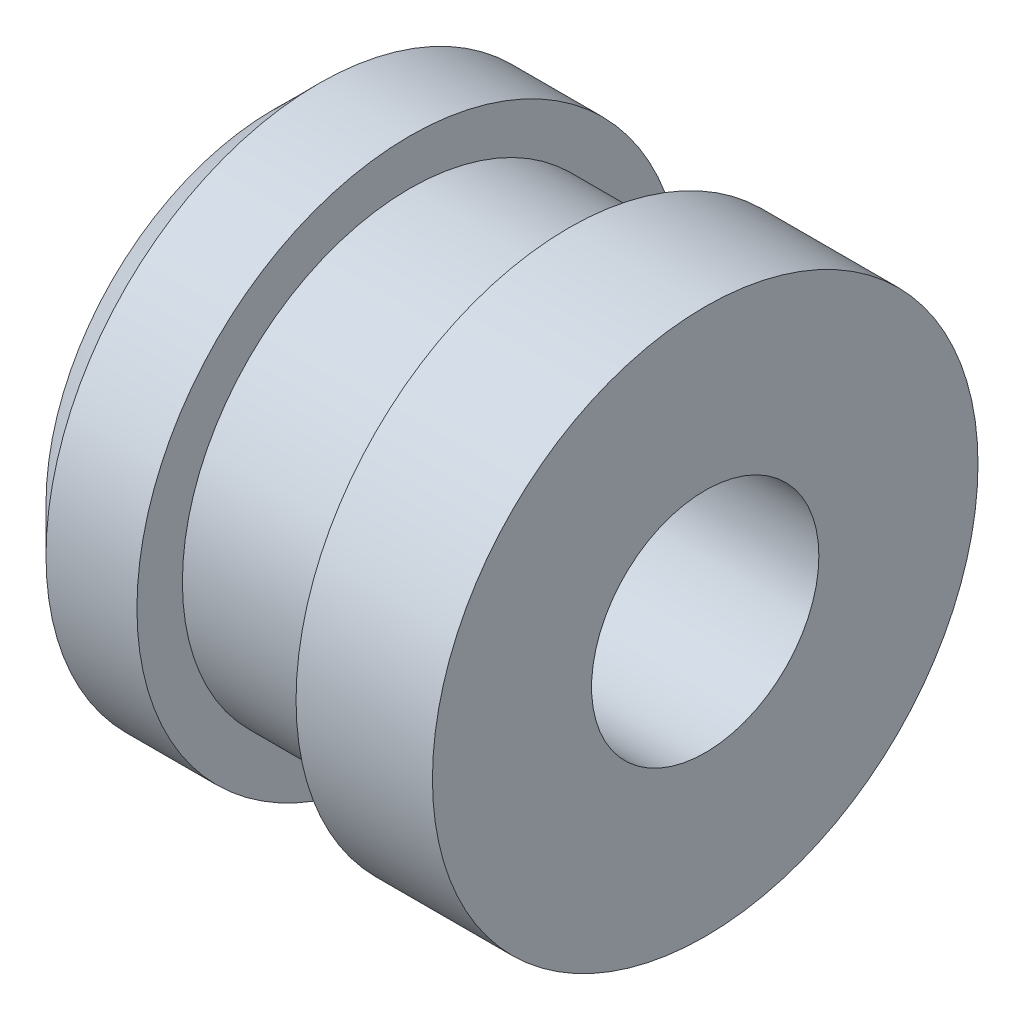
ISO-10303-21;
HEADER;
FILE_DESCRIPTION(('STEP AP214'),'2;1');
FILE_NAME('part.step','',(''),(''),'','','');
FILE_SCHEMA(('AUTOMOTIVE_DESIGN { 1 0 10303 214 1 1 1 1 }'));
ENDSEC;
DATA;
#1=APPLICATION_CONTEXT('core data for automotive mechanical design processes');
#2=APPLICATION_PROTOCOL_DEFINITION('international standard','automotive_design',2000,#1);
#3=PRODUCT_CONTEXT('',#1,'mechanical');
#4=PRODUCT('Part','Part','',(#3));
#5=PRODUCT_RELATED_PRODUCT_CATEGORY('part','',(#4));
#6=PRODUCT_DEFINITION_FORMATION('','',#4);
#7=PRODUCT_DEFINITION_CONTEXT('part definition',#1,'design');
#8=PRODUCT_DEFINITION('design','',#6,#7);
#9=PRODUCT_DEFINITION_SHAPE('','',#8);
#10=(LENGTH_UNIT() NAMED_UNIT(*) SI_UNIT(.MILLI.,.METRE.));
#11=(NAMED_UNIT(*) PLANE_ANGLE_UNIT() SI_UNIT($,.RADIAN.));
#12=(NAMED_UNIT(*) SI_UNIT($,.STERADIAN.) SOLID_ANGLE_UNIT());
#13=UNCERTAINTY_MEASURE_WITH_UNIT(LENGTH_MEASURE(1.E-05),#10,'distance_accuracy_value','');
#14=(GEOMETRIC_REPRESENTATION_CONTEXT(3) GLOBAL_UNCERTAINTY_ASSIGNED_CONTEXT((#13)) GLOBAL_UNIT_ASSIGNED_CONTEXT((#10,
#11,#12)) REPRESENTATION_CONTEXT('',''));
#15=CARTESIAN_POINT('',(0.,0.,0.));
#16=DIRECTION('',(0.,0.,1.));
#17=DIRECTION('',(1.,0.,0.));
#18=AXIS2_PLACEMENT_3D('',#15,#16,#17);
#19=CARTESIAN_POINT('',(0.,0.,-6.));
#20=DIRECTION('',(1.,0.,0.));
#21=DIRECTION('',(0.,0.,-1.));
#22=AXIS2_PLACEMENT_3D('',#19,#20,#21);
#23=PLANE('',#22);
#24=CARTESIAN_POINT('',(0.,0.,0.));
#25=DIRECTION('',(1.,0.,0.));
#26=DIRECTION('',(0.,0.,-1.));
#27=AXIS2_PLACEMENT_3D('',#24,#25,#26);
#28=CIRCLE('',#27,5.);
#29=CARTESIAN_POINT('',(0.,0.,-5.));
#30=VERTEX_POINT('',#29);
#31=EDGE_CURVE('E36',#30,#30,#28,.F.);
#32=ORIENTED_EDGE('',*,*,#31,.T.);
#33=EDGE_LOOP('',(#32));
#34=FACE_BOUND('',#33,.T.);
#35=ADVANCED_FACE('F30',(#34),#23,.F.);
#36=CARTESIAN_POINT('',(9.49999999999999,0.,0.));
#37=DIRECTION('',(-1.,0.,0.));
#38=DIRECTION('',(0.,0.,1.));
#39=AXIS2_PLACEMENT_3D('',#36,#37,#38);
#40=PLANE('',#39);
#41=CARTESIAN_POINT('',(9.49999999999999,0.,0.));
#42=DIRECTION('',(1.,0.,0.));
#43=DIRECTION('',(0.,0.,-1.));
#44=AXIS2_PLACEMENT_3D('',#41,#42,#43);
#45=CIRCLE('',#44,2.5);
#46=CARTESIAN_POINT('',(9.49999999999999,0.,-2.5));
#47=VERTEX_POINT('',#46);
#48=EDGE_CURVE('E61',#47,#47,#45,.T.);
#49=ORIENTED_EDGE('',*,*,#48,.F.);
#50=EDGE_LOOP('',(#49));
#51=FACE_BOUND('',#50,.T.);
#52=CARTESIAN_POINT('',(9.49999999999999,0.,0.));
#53=DIRECTION('',(-1.,0.,0.));
#54=DIRECTION('',(0.,0.,1.));
#55=AXIS2_PLACEMENT_3D('',#52,#53,#54);
#56=CIRCLE('',#55,6.);
#57=CARTESIAN_POINT('',(9.49999999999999,0.,6.));
#58=VERTEX_POINT('',#57);
#59=EDGE_CURVE('E40',#58,#58,#56,.T.);
#60=ORIENTED_EDGE('',*,*,#59,.F.);
#61=EDGE_LOOP('',(#60));
#62=FACE_BOUND('',#61,.T.);
#63=ADVANCED_FACE('F67',(#51,#62),#40,.F.);
#64=CARTESIAN_POINT('',(0.,0.,0.));
#65=DIRECTION('',(-1.,0.,0.));
#66=DIRECTION('',(0.,0.,1.));
#67=AXIS2_PLACEMENT_3D('',#64,#65,#66);
#68=CYLINDRICAL_SURFACE('',#67,6.);
#69=CARTESIAN_POINT('',(6.49999999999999,0.,0.));
#70=DIRECTION('',(-1.,0.,0.));
#71=DIRECTION('',(0.,0.,1.));
#72=AXIS2_PLACEMENT_3D('',#69,#70,#71);
#73=CIRCLE('',#72,6.);
#74=CARTESIAN_POINT('',(6.49999999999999,0.,6.));
#75=VERTEX_POINT('',#74);
#76=EDGE_CURVE('E44',#75,#75,#73,.T.);
#77=ORIENTED_EDGE('',*,*,#76,.F.);
#78=EDGE_LOOP('',(#77));
#79=FACE_BOUND('',#78,.T.);
#80=ORIENTED_EDGE('',*,*,#59,.T.);
#81=EDGE_LOOP('',(#80));
#82=FACE_BOUND('',#81,.T.);
#83=ADVANCED_FACE('F70',(#79,#82),#68,.T.);
#84=CARTESIAN_POINT('',(6.49999999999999,0.,-6.));
#85=DIRECTION('',(1.,0.,0.));
#86=DIRECTION('',(0.,0.,-1.));
#87=AXIS2_PLACEMENT_3D('',#84,#85,#86);
#88=PLANE('',#87);
#89=CARTESIAN_POINT('',(6.49999999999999,0.,0.));
#90=DIRECTION('',(-1.,0.,0.));
#91=DIRECTION('',(0.,0.,1.));
#92=AXIS2_PLACEMENT_3D('',#89,#90,#91);
#93=CIRCLE('',#92,5.);
#94=CARTESIAN_POINT('',(6.49999999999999,0.,5.));
#95=VERTEX_POINT('',#94);
#96=EDGE_CURVE('E49',#95,#95,#93,.T.);
#97=ORIENTED_EDGE('',*,*,#96,.F.);
#98=EDGE_LOOP('',(#97));
#99=FACE_BOUND('',#98,.T.);
#100=ORIENTED_EDGE('',*,*,#76,.T.);
#101=EDGE_LOOP('',(#100));
#102=FACE_BOUND('',#101,.T.);
#103=ADVANCED_FACE('F74',(#99,#102),#88,.F.);
#104=CARTESIAN_POINT('',(0.,0.,0.));
#105=DIRECTION('',(-1.,0.,0.));
#106=DIRECTION('',(0.,0.,1.));
#107=AXIS2_PLACEMENT_3D('',#104,#105,#106);
#108=CYLINDRICAL_SURFACE('',#107,5.);
#109=CARTESIAN_POINT('',(3.00000000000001,0.,0.));
#110=DIRECTION('',(-1.,0.,0.));
#111=DIRECTION('',(0.,0.,1.));
#112=AXIS2_PLACEMENT_3D('',#109,#110,#111);
#113=CIRCLE('',#112,5.);
#114=CARTESIAN_POINT('',(3.00000000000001,0.,5.));
#115=VERTEX_POINT('',#114);
#116=EDGE_CURVE('E52',#115,#115,#113,.T.);
#117=ORIENTED_EDGE('',*,*,#116,.F.);
#118=EDGE_LOOP('',(#117));
#119=FACE_BOUND('',#118,.T.);
#120=ORIENTED_EDGE('',*,*,#96,.T.);
#121=EDGE_LOOP('',(#120));
#122=FACE_BOUND('',#121,.T.);
#123=ADVANCED_FACE('F80',(#119,#122),#108,.T.);
#124=CARTESIAN_POINT('',(3.00000000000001,0.,-5.));
#125=DIRECTION('',(-1.,0.,0.));
#126=DIRECTION('',(0.,0.,1.));
#127=AXIS2_PLACEMENT_3D('',#124,#125,#126);
#128=PLANE('',#127);
#129=CARTESIAN_POINT('',(3.00000000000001,0.,0.));
#130=DIRECTION('',(-1.,0.,0.));
#131=DIRECTION('',(0.,0.,1.));
#132=AXIS2_PLACEMENT_3D('',#129,#130,#131);
#133=CIRCLE('',#132,6.);
#134=CARTESIAN_POINT('',(3.00000000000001,0.,6.));
#135=VERTEX_POINT('',#134);
#136=EDGE_CURVE('E55',#135,#135,#133,.T.);
#137=ORIENTED_EDGE('',*,*,#136,.F.);
#138=EDGE_LOOP('',(#137));
#139=FACE_BOUND('',#138,.T.);
#140=ORIENTED_EDGE('',*,*,#116,.T.);
#141=EDGE_LOOP('',(#140));
#142=FACE_BOUND('',#141,.T.);
#143=ADVANCED_FACE('F130',(#139,#142),#128,.F.);
#144=CARTESIAN_POINT('',(0.,0.,0.));
#145=DIRECTION('',(-1.,0.,0.));
#146=DIRECTION('',(0.,0.,1.));
#147=AXIS2_PLACEMENT_3D('',#144,#145,#146);
#148=CYLINDRICAL_SURFACE('',#147,6.);
#149=CARTESIAN_POINT('',(1.00000000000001,0.,0.));
#150=DIRECTION('',(1.,0.,0.));
#151=DIRECTION('',(0.,0.,-1.));
#152=AXIS2_PLACEMENT_3D('',#149,#150,#151);
#153=CIRCLE('',#152,6.);
#154=CARTESIAN_POINT('',(1.00000000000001,0.,-6.));
#155=VERTEX_POINT('',#154);
#156=EDGE_CURVE('E10',#155,#155,#153,.T.);
#157=ORIENTED_EDGE('',*,*,#156,.T.);
#158=EDGE_LOOP('',(#157));
#159=FACE_BOUND('',#158,.T.);
#160=ORIENTED_EDGE('',*,*,#136,.T.);
#161=EDGE_LOOP('',(#160));
#162=FACE_BOUND('',#161,.T.);
#163=ADVANCED_FACE('F125',(#159,#162),#148,.T.);
#164=CARTESIAN_POINT('',(0.,0.,0.));
#165=DIRECTION('',(1.,0.,0.));
#166=DIRECTION('',(0.,0.,-1.));
#167=AXIS2_PLACEMENT_3D('',#164,#165,#166);
#168=CONICAL_SURFACE('',#167,5.,0.785398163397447);
#169=ORIENTED_EDGE('',*,*,#156,.F.);
#170=EDGE_LOOP('',(#169));
#171=FACE_BOUND('',#170,.T.);
#172=ORIENTED_EDGE('',*,*,#31,.F.);
#173=EDGE_LOOP('',(#172));
#174=FACE_BOUND('',#173,.T.);
#175=ADVANCED_FACE('F100',(#171,#174),#168,.T.);
#176=CARTESIAN_POINT('',(1.49999999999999,0.,0.));
#177=DIRECTION('',(1.,0.,0.));
#178=DIRECTION('',(0.,0.,-1.));
#179=AXIS2_PLACEMENT_3D('',#176,#177,#178);
#180=CYLINDRICAL_SURFACE('',#179,2.5);
#181=CARTESIAN_POINT('',(1.49999999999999,0.,0.));
#182=DIRECTION('',(1.,0.,0.));
#183=DIRECTION('',(0.,0.,-1.));
#184=AXIS2_PLACEMENT_3D('',#181,#182,#183);
#185=CIRCLE('',#184,2.5);
#186=CARTESIAN_POINT('',(1.49999999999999,0.,-2.5));
#187=VERTEX_POINT('',#186);
#188=EDGE_CURVE('E58',#187,#187,#185,.T.);
#189=ORIENTED_EDGE('',*,*,#188,.F.);
#190=EDGE_LOOP('',(#189));
#191=FACE_BOUND('',#190,.T.);
#192=ORIENTED_EDGE('',*,*,#48,.T.);
#193=EDGE_LOOP('',(#192));
#194=FACE_BOUND('',#193,.T.);
#195=ADVANCED_FACE('F65',(#191,#194),#180,.F.);
#196=CARTESIAN_POINT('',(1.49999999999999,0.,0.));
#197=DIRECTION('',(1.,0.,0.));
#198=DIRECTION('',(0.,0.,-1.));
#199=AXIS2_PLACEMENT_3D('',#196,#197,#198);
#200=PLANE('',#199);
#201=ORIENTED_EDGE('',*,*,#188,.T.);
#202=EDGE_LOOP('',(#201));
#203=FACE_BOUND('',#202,.T.);
#204=ADVANCED_FACE('F109',(#203),#200,.T.);
#205=CLOSED_SHELL('',(#35,#63,#83,#103,#123,#143,#163,#175,#195,#204));
#206=MANIFOLD_SOLID_BREP('B2',#205);
#207=ADVANCED_BREP_SHAPE_REPRESENTATION('',(#18,#206),#14);
#208=SHAPE_DEFINITION_REPRESENTATION(#9,#207);
ENDSEC;
END-ISO-10303-21;
